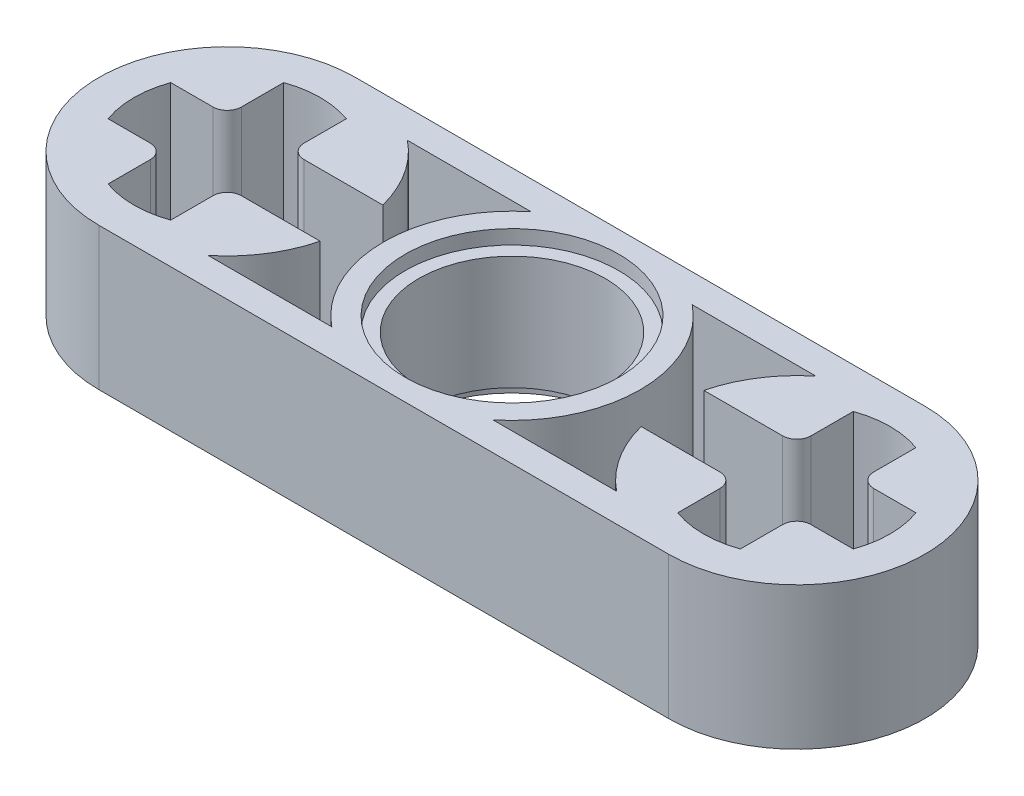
from build123d import *

# Parameters (mm, degrees)
SKETCH1_R           = 2.618175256
BOSS_EXTRUDE1_DEPTH = 4
SKETCH2_R           = 3
CUT_EXTRUDE1_DEPTH  = 0.4
CUT_EXTRUDE2_START  = -0.4
SKETCH3_R           = 3
CUT_EXTRUDE2_DEPTH  = 0.4
CUT_EXTRUDE3_DEPTH  = 4


with BuildPart() as part:
    # Sketch1 → Boss-Extrude1 (new body)
    with BuildSketch(Plane(origin=(0, 0, 0), x_dir=(1, 0, 0), z_dir=(0, 1, 0))):
        with BuildLine():
            Line((-8, -3.6), (8, -3.6))
            ThreePointArc((8, -3.6), (11.6, 0), (8, 3.6))
            Line((8, 3.6), (-8, 3.6))
            ThreePointArc((-8, 3.6), (-11.6, 0), (-8, -3.6))
        make_face()
        with Locations(Location((0, 0, 0), (0, 0, 270))):
            Circle(SKETCH1_R, mode=Mode.SUBTRACT)
        with BuildLine():
            Line((-10.46585516, 0.88), (-9.28, 0.88))
            ThreePointArc((-9.28, 0.88), (-8.997157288, 0.997157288), (-8.88, 1.28))
            Line((-8.88, 1.28), (-8.88, 2.46585516))
            ThreePointArc((-8.88, 2.46585516), (-8, 2.618175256), (-7.12, 2.46585516))
            Line((-7.12, 2.46585516), (-7.12, 1.28))
            ThreePointArc((-7.12, 1.28), (-7.002842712, 0.997157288), (-6.72, 0.88))
            Line((-6.72, 0.88), (-5.53414484, 0.88))
            ThreePointArc((-5.53414484, 0.88), (-5.381824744, 0), (-5.53414484, -0.88))
            Line((-5.53414484, -0.88), (-6.72, -0.88))
            ThreePointArc((-6.72, -0.88), (-7.002842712, -0.997157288), (-7.12, -1.28))
            Line((-7.12, -1.28), (-7.12, -2.46585516))
            ThreePointArc((-7.12, -2.46585516), (-8, -2.618175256), (-8.88, -2.46585516))
            Line((-8.88, -2.46585516), (-8.88, -1.28))
            ThreePointArc((-8.88, -1.28), (-8.997157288, -0.997157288), (-9.28, -0.88))
            Line((-9.28, -0.88), (-10.46585516, -0.88))
            ThreePointArc((-10.46585516, -0.88), (-10.618175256, 0), (-10.46585516, 0.88))
        make_face(mode=Mode.SUBTRACT)
        with BuildLine():
            Line((7.12, 2.46585516), (7.12, 1.28))
            ThreePointArc((7.12, 1.28), (7.002842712, 0.997157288), (6.72, 0.88))
            Line((6.72, 0.88), (5.53414484, 0.88))
            ThreePointArc((5.53414484, 0.88), (5.381824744, 0), (5.53414484, -0.88))
            Line((5.53414484, -0.88), (6.72, -0.88))
            ThreePointArc((6.72, -0.88), (7.002842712, -0.997157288), (7.12, -1.28))
            Line((7.12, -1.28), (7.12, -2.46585516))
            ThreePointArc((7.12, -2.46585516), (8, -2.618175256), (8.88, -2.46585516))
            Line((8.88, -2.46585516), (8.88, -1.28))
            ThreePointArc((8.88, -1.28), (8.997157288, -0.997157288), (9.28, -0.88))
            Line((9.28, -0.88), (10.46585516, -0.88))
            ThreePointArc((10.46585516, -0.88), (10.618175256, 0), (10.46585516, 0.88))
            Line((10.46585516, 0.88), (9.28, 0.88))
            ThreePointArc((9.28, 0.88), (8.997157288, 0.997157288), (8.88, 1.28))
            Line((8.88, 1.28), (8.88, 2.46585516))
            ThreePointArc((8.88, 2.46585516), (8, 2.618175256), (7.12, 2.46585516))
        make_face(mode=Mode.SUBTRACT)
    extrude(amount=BOSS_EXTRUDE1_DEPTH)

    # Sketch2 → Cut-Extrude1 (cut)
    with BuildSketch(Plane(origin=(0, 4, 0), x_dir=(1, 0, 0), z_dir=(0, 1, 0))):
        with Locations(Location((0, 0, 0), (0, 0, 270))):
            Circle(SKETCH2_R)
    extrude(amount=-CUT_EXTRUDE1_DEPTH, mode=Mode.SUBTRACT)

    # Sketch3 → Cut-Extrude2 (cut)
    with BuildSketch(Plane.XZ.offset(CUT_EXTRUDE2_START)):
        with Locations(Location((0, 0, 0), (0, 0, 90))):
            Circle(SKETCH3_R)
    extrude(amount=CUT_EXTRUDE2_DEPTH, mode=Mode.SUBTRACT)

    # Sketch4 → Cut-Extrude3 (cut)
    with BuildSketch(Plane.XZ):
        with BuildLine():
            Line((-5.7372583, 2.8), (-2.2627417, 2.8))
            ThreePointArc((-2.2627417, 2.8), (-3.6, 0), (-2.2627417, -2.8))
            Line((-2.2627417, -2.8), (-5.7372583, -2.8))
            ThreePointArc((-5.7372583, -2.8), (-4.967282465, -1.939748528), (-4.509212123, -0.88))
            Line((-4.509212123, -0.88), (-5.53414484, -0.88))
            Line((-5.53414484, -0.88), (-5.53414484, 0.88))
            Line((-5.53414484, 0.88), (-4.509212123, 0.88))
            ThreePointArc((-4.509212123, 0.88), (-4.967282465, 1.939748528), (-5.7372583, 2.8))
        make_face()
        with BuildLine():
            Line((2.2627417, -2.8), (5.7372583, -2.8))
            ThreePointArc((5.7372583, -2.8), (4.967282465, -1.939748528), (4.509212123, -0.88))
            Line((4.509212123, -0.88), (5.53414484, -0.88))
            Line((5.53414484, -0.88), (5.53414484, 0.88))
            Line((5.53414484, 0.88), (4.509212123, 0.88))
            ThreePointArc((4.509212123, 0.88), (4.967282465, 1.939748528), (5.7372583, 2.8))
            Line((5.7372583, 2.8), (2.2627417, 2.8))
            ThreePointArc((2.2627417, 2.8), (3.6, 0), (2.2627417, -2.8))
        make_face()
    extrude(amount=-CUT_EXTRUDE3_DEPTH, mode=Mode.SUBTRACT)


solid = part.part
